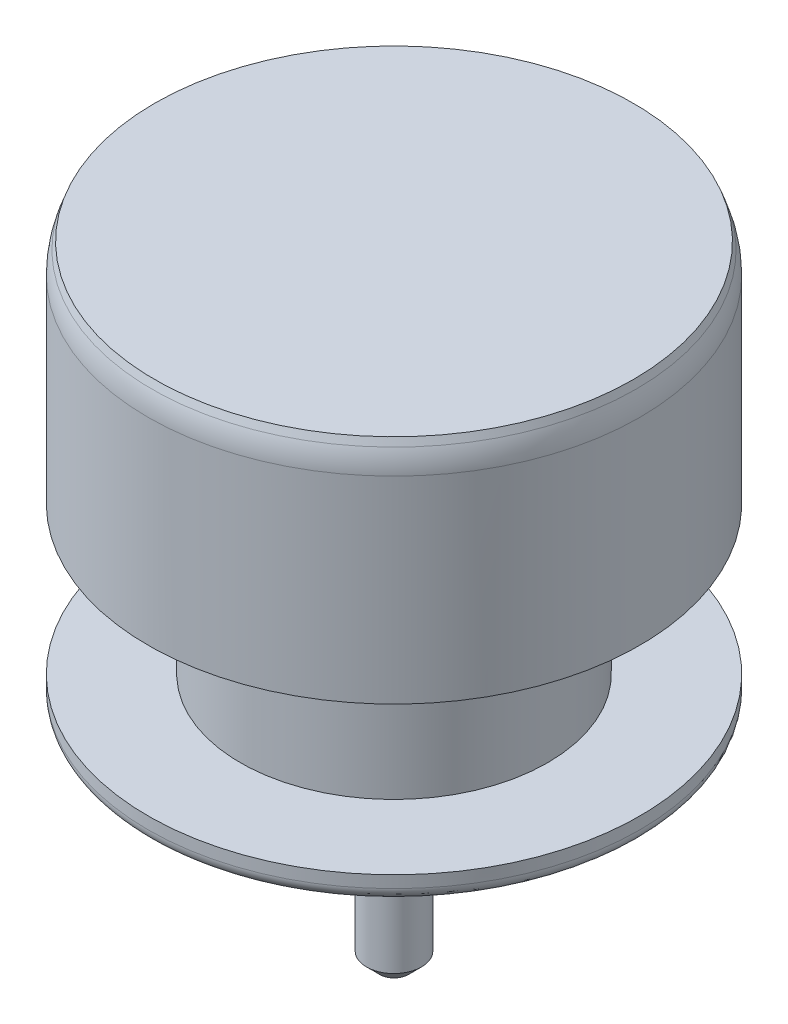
ISO-10303-21;
HEADER;
FILE_DESCRIPTION(('STEP AP214'),'2;1');
FILE_NAME('part.step','',(''),(''),'','','');
FILE_SCHEMA(('AUTOMOTIVE_DESIGN { 1 0 10303 214 1 1 1 1 }'));
ENDSEC;
DATA;
#1=APPLICATION_CONTEXT('core data for automotive mechanical design processes');
#2=APPLICATION_PROTOCOL_DEFINITION('international standard','automotive_design',2000,#1);
#3=PRODUCT_CONTEXT('',#1,'mechanical');
#4=PRODUCT('Part','Part','',(#3));
#5=PRODUCT_RELATED_PRODUCT_CATEGORY('part','',(#4));
#6=PRODUCT_DEFINITION_FORMATION('','',#4);
#7=PRODUCT_DEFINITION_CONTEXT('part definition',#1,'design');
#8=PRODUCT_DEFINITION('design','',#6,#7);
#9=PRODUCT_DEFINITION_SHAPE('','',#8);
#10=(LENGTH_UNIT() NAMED_UNIT(*) SI_UNIT(.MILLI.,.METRE.));
#11=(NAMED_UNIT(*) PLANE_ANGLE_UNIT() SI_UNIT($,.RADIAN.));
#12=(NAMED_UNIT(*) SI_UNIT($,.STERADIAN.) SOLID_ANGLE_UNIT());
#13=UNCERTAINTY_MEASURE_WITH_UNIT(LENGTH_MEASURE(1.E-05),#10,'distance_accuracy_value','');
#14=(GEOMETRIC_REPRESENTATION_CONTEXT(3) GLOBAL_UNCERTAINTY_ASSIGNED_CONTEXT((#13)) GLOBAL_UNIT_ASSIGNED_CONTEXT((#10,
#11,#12)) REPRESENTATION_CONTEXT('',''));
#15=CARTESIAN_POINT('',(0.,0.,0.));
#16=DIRECTION('',(0.,0.,1.));
#17=DIRECTION('',(1.,0.,0.));
#18=AXIS2_PLACEMENT_3D('',#15,#16,#17);
#19=CARTESIAN_POINT('',(3.66,0.,0.));
#20=DIRECTION('',(0.,-1.,0.));
#21=DIRECTION('',(1.,0.,0.));
#22=AXIS2_PLACEMENT_3D('',#19,#20,#21);
#23=PLANE('',#22);
#24=CARTESIAN_POINT('',(0.,0.,0.));
#25=DIRECTION('',(0.,1.,0.));
#26=DIRECTION('',(-1.,0.,0.));
#27=AXIS2_PLACEMENT_3D('',#24,#25,#26);
#28=CIRCLE('',#27,3.66);
#29=CARTESIAN_POINT('',(-3.66,0.,0.));
#30=VERTEX_POINT('',#29);
#31=EDGE_CURVE('E75',#30,#30,#28,.T.);
#32=ORIENTED_EDGE('',*,*,#31,.T.);
#33=EDGE_LOOP('',(#32));
#34=FACE_BOUND('',#33,.T.);
#35=ADVANCED_FACE('F34',(#34),#23,.F.);
#36=CARTESIAN_POINT('',(0.420000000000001,-9.6,0.));
#37=DIRECTION('',(0.,1.,0.));
#38=DIRECTION('',(-1.,0.,0.));
#39=AXIS2_PLACEMENT_3D('',#36,#37,#38);
#40=PLANE('',#39);
#41=CARTESIAN_POINT('',(0.,-9.6,0.));
#42=DIRECTION('',(0.,1.,0.));
#43=DIRECTION('',(-1.,0.,0.));
#44=AXIS2_PLACEMENT_3D('',#41,#42,#43);
#45=CIRCLE('',#44,0.219999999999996);
#46=CARTESIAN_POINT('',(-0.219999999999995,-9.6,0.));
#47=VERTEX_POINT('',#46);
#48=EDGE_CURVE('E10',#47,#47,#45,.F.);
#49=ORIENTED_EDGE('',*,*,#48,.T.);
#50=EDGE_LOOP('',(#49));
#51=FACE_BOUND('',#50,.T.);
#52=ADVANCED_FACE('F97',(#51),#40,.F.);
#53=CARTESIAN_POINT('',(0.,0.,0.));
#54=DIRECTION('',(0.,1.,0.));
#55=DIRECTION('',(-1.,0.,0.));
#56=AXIS2_PLACEMENT_3D('',#53,#54,#55);
#57=CYLINDRICAL_SURFACE('',#56,0.42);
#58=CARTESIAN_POINT('',(0.,-9.4,0.));
#59=DIRECTION('',(0.,1.,0.));
#60=DIRECTION('',(-1.,0.,0.));
#61=AXIS2_PLACEMENT_3D('',#58,#59,#60);
#62=CIRCLE('',#61,0.42);
#63=CARTESIAN_POINT('',(-0.419999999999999,-9.4,0.));
#64=VERTEX_POINT('',#63);
#65=EDGE_CURVE('E41',#64,#64,#62,.T.);
#66=ORIENTED_EDGE('',*,*,#65,.T.);
#67=EDGE_LOOP('',(#66));
#68=FACE_BOUND('',#67,.T.);
#69=CARTESIAN_POINT('',(0.,-7.95751288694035,0.));
#70=DIRECTION('',(0.,1.,0.));
#71=DIRECTION('',(-1.,0.,0.));
#72=AXIS2_PLACEMENT_3D('',#69,#70,#71);
#73=CIRCLE('',#72,0.42);
#74=CARTESIAN_POINT('',(-0.419999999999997,-7.95751288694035,0.));
#75=VERTEX_POINT('',#74);
#76=EDGE_CURVE('E60',#75,#75,#73,.T.);
#77=ORIENTED_EDGE('',*,*,#76,.F.);
#78=EDGE_LOOP('',(#77));
#79=FACE_BOUND('',#78,.T.);
#80=ADVANCED_FACE('F102',(#68,#79),#57,.T.);
#81=CARTESIAN_POINT('',(0.,-7.95751288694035,0.));
#82=DIRECTION('',(0.,1.,0.));
#83=DIRECTION('',(-1.,0.,0.));
#84=AXIS2_PLACEMENT_3D('',#81,#82,#83);
#85=CONICAL_SURFACE('',#84,0.42,1.04719755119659);
#86=CARTESIAN_POINT('',(0.,-6.08689801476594,0.));
#87=DIRECTION('',(0.,-1.,0.));
#88=DIRECTION('',(1.,0.,0.));
#89=AXIS2_PLACEMENT_3D('',#86,#87,#88);
#90=CIRCLE('',#89,3.66);
#91=CARTESIAN_POINT('',(-3.66,-6.08689801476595,0.));
#92=VERTEX_POINT('',#91);
#93=EDGE_CURVE('E54',#92,#92,#90,.T.);
#94=CARTESIAN_POINT('',(-3.66,-6.08689801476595,0.));
#95=CARTESIAN_POINT('',(-3.62625,-6.10638358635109,0.));
#96=CARTESIAN_POINT('',(-3.5925,-6.12586915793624,0.));
#97=CARTESIAN_POINT('',(-3.525,-6.16484030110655,0.));
#98=CARTESIAN_POINT('',(-3.49125,-6.1843258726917,0.));
#99=CARTESIAN_POINT('',(-3.42375,-6.223297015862,0.));
#100=CARTESIAN_POINT('',(-3.39,-6.24278258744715,0.));
#101=CARTESIAN_POINT('',(-3.3225,-6.28175373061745,0.));
#102=CARTESIAN_POINT('',(-3.28875,-6.3012393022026,0.));
#103=CARTESIAN_POINT('',(-3.22125,-6.3402104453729,0.));
#104=CARTESIAN_POINT('',(-3.1875,-6.35969601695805,0.));
#105=CARTESIAN_POINT('',(-3.12,-6.39866716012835,0.));
#106=CARTESIAN_POINT('',(-3.08625,-6.4181527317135,0.));
#107=CARTESIAN_POINT('',(-3.01875,-6.4571238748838,0.));
#108=CARTESIAN_POINT('',(-2.985,-6.47660944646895,0.));
#109=CARTESIAN_POINT('',(-2.9175,-6.51558058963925,0.));
#110=CARTESIAN_POINT('',(-2.88375,-6.5350661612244,0.));
#111=CARTESIAN_POINT('',(-2.81625,-6.5740373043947,0.));
#112=CARTESIAN_POINT('',(-2.7825,-6.59352287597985,0.));
#113=CARTESIAN_POINT('',(-2.715,-6.63249401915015,0.));
#114=CARTESIAN_POINT('',(-2.68125,-6.6519795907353,0.));
#115=CARTESIAN_POINT('',(-2.61375,-6.6909507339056,0.));
#116=CARTESIAN_POINT('',(-2.58,-6.71043630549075,0.));
#117=CARTESIAN_POINT('',(-2.5125,-6.74940744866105,0.));
#118=CARTESIAN_POINT('',(-2.47875,-6.7688930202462,0.));
#119=CARTESIAN_POINT('',(-2.41125,-6.8078641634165,0.));
#120=CARTESIAN_POINT('',(-2.3775,-6.82734973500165,0.));
#121=CARTESIAN_POINT('',(-2.31,-6.86632087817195,0.));
#122=CARTESIAN_POINT('',(-2.27625,-6.8858064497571,0.));
#123=CARTESIAN_POINT('',(-2.20875,-6.9247775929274,0.));
#124=CARTESIAN_POINT('',(-2.175,-6.94426316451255,0.));
#125=CARTESIAN_POINT('',(-2.1075,-6.98323430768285,0.));
#126=CARTESIAN_POINT('',(-2.07375,-7.002719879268,0.));
#127=CARTESIAN_POINT('',(-2.00625,-7.0416910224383,0.));
#128=CARTESIAN_POINT('',(-1.9725,-7.06117659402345,0.));
#129=CARTESIAN_POINT('',(-1.905,-7.10014773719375,0.));
#130=CARTESIAN_POINT('',(-1.87125,-7.1196333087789,0.));
#131=CARTESIAN_POINT('',(-1.80375,-7.1586044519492,0.));
#132=CARTESIAN_POINT('',(-1.77,-7.17809002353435,0.));
#133=CARTESIAN_POINT('',(-1.7025,-7.21706116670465,0.));
#134=CARTESIAN_POINT('',(-1.66875,-7.2365467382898,0.));
#135=CARTESIAN_POINT('',(-1.60125,-7.2755178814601,0.));
#136=CARTESIAN_POINT('',(-1.5675,-7.29500345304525,0.));
#137=CARTESIAN_POINT('',(-1.5,-7.33397459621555,0.));
#138=CARTESIAN_POINT('',(-1.46625,-7.3534601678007,0.));
#139=CARTESIAN_POINT('',(-1.39875,-7.392431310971,0.));
#140=CARTESIAN_POINT('',(-1.365,-7.41191688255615,0.));
#141=CARTESIAN_POINT('',(-1.2975,-7.45088802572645,0.));
#142=CARTESIAN_POINT('',(-1.26375,-7.4703735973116,0.));
#143=CARTESIAN_POINT('',(-1.19625,-7.5093447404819,0.));
#144=CARTESIAN_POINT('',(-1.1625,-7.52883031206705,0.));
#145=CARTESIAN_POINT('',(-1.095,-7.56780145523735,0.));
#146=CARTESIAN_POINT('',(-1.06125,-7.5872870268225,0.));
#147=CARTESIAN_POINT('',(-0.993749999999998,-7.6262581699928,0.));
#148=CARTESIAN_POINT('',(-0.959999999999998,-7.64574374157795,0.));
#149=CARTESIAN_POINT('',(-0.892499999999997,-7.68471488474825,0.));
#150=CARTESIAN_POINT('',(-0.858749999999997,-7.7042004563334,0.));
#151=CARTESIAN_POINT('',(-0.791249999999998,-7.7431715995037,0.));
#152=CARTESIAN_POINT('',(-0.757499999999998,-7.76265717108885,0.));
#153=CARTESIAN_POINT('',(-0.689999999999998,-7.80162831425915,0.));
#154=CARTESIAN_POINT('',(-0.656249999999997,-7.8211138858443,0.));
#155=CARTESIAN_POINT('',(-0.588749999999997,-7.8600850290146,0.));
#156=CARTESIAN_POINT('',(-0.554999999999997,-7.87957060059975,0.));
#157=CARTESIAN_POINT('',(-0.487499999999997,-7.91854174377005,0.));
#158=CARTESIAN_POINT('',(-0.453749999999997,-7.9380273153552,0.));
#159=CARTESIAN_POINT('',(-0.419999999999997,-7.95751288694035,0.));
#160=B_SPLINE_CURVE_WITH_KNOTS('',3,(#94,#95,#96,#97,#98,#99,#100,#101,#102,#103,#104,#105,#106,
#107,#108,#109,#110,#111,#112,#113,#114,#115,#116,#117,#118,#119,#120,#121,#122,#123,#124,#125,
#126,#127,#128,#129,#130,#131,#132,#133,#134,#135,#136,#137,#138,#139,#140,#141,#142,#143,#144,
#145,#146,#147,#148,#149,#150,#151,#152,#153,#154,#155,#156,#157,#158,#159),.UNSPECIFIED.,.F.,
.F.,(4,2,2,2,2,2,2,2,2,2,2,2,2,2,2,2,2,2,2,2,2,2,2,2,2,2,2,2,2,2,2,2,4),(0.,0.116913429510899,
0.233826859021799,0.350740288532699,0.467653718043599,0.584567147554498,0.701480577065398,
0.818394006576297,0.935307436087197,1.0522208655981,1.169134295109,1.2860477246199,
1.40296115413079,1.51987458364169,1.63678801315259,1.75370144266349,1.87061487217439,
1.98752830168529,2.10444173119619,2.22135516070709,2.33826859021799,2.45518201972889,
2.57209544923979,2.68900887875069,2.80592230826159,2.92283573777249,3.03974916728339,
3.15666259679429,3.27357602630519,3.39048945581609,3.50740288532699,3.62431631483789,
3.74122974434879),.UNSPECIFIED.);
#161=EDGE_CURVE('BSEAM136',#92,#75,#160,.T.);
#162=ORIENTED_EDGE('',*,*,#93,.T.);
#163=ORIENTED_EDGE('',*,*,#76,.T.);
#164=ORIENTED_EDGE('',*,*,#161,.T.);
#165=ORIENTED_EDGE('',*,*,#161,.F.);
#166=EDGE_LOOP('',(#162,#164,#163,#165));
#167=FACE_BOUND('',#166,.T.);
#168=ADVANCED_FACE('F136',(#167),#85,.T.);
#169=CARTESIAN_POINT('',(0.,0.,0.));
#170=DIRECTION('',(0.,1.,0.));
#171=DIRECTION('',(-1.,0.,0.));
#172=AXIS2_PLACEMENT_3D('',#169,#170,#171);
#173=CYLINDRICAL_SURFACE('',#172,3.76);
#174=CARTESIAN_POINT('',(0.,-5.91369293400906,0.));
#175=DIRECTION('',(0.,-1.,0.));
#176=DIRECTION('',(1.,0.,0.));
#177=AXIS2_PLACEMENT_3D('',#174,#175,#176);
#178=CIRCLE('',#177,3.76);
#179=CARTESIAN_POINT('',(3.76,-5.91369293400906,0.));
#180=VERTEX_POINT('',#179);
#181=EDGE_CURVE('E57',#180,#180,#178,.F.);
#182=ORIENTED_EDGE('',*,*,#181,.T.);
#183=EDGE_LOOP('',(#182));
#184=FACE_BOUND('',#183,.T.);
#185=CARTESIAN_POINT('',(0.,-5.73,0.));
#186=DIRECTION('',(0.,1.,0.));
#187=DIRECTION('',(-1.,0.,0.));
#188=AXIS2_PLACEMENT_3D('',#185,#186,#187);
#189=CIRCLE('',#188,3.76);
#190=CARTESIAN_POINT('',(-3.76,-5.73,0.));
#191=VERTEX_POINT('',#190);
#192=EDGE_CURVE('E63',#191,#191,#189,.T.);
#193=ORIENTED_EDGE('',*,*,#192,.F.);
#194=EDGE_LOOP('',(#193));
#195=FACE_BOUND('',#194,.T.);
#196=ADVANCED_FACE('F131',(#184,#195),#173,.T.);
#197=CARTESIAN_POINT('',(3.76,-5.73,0.));
#198=DIRECTION('',(0.,-1.,0.));
#199=DIRECTION('',(1.,0.,0.));
#200=AXIS2_PLACEMENT_3D('',#197,#198,#199);
#201=PLANE('',#200);
#202=CARTESIAN_POINT('',(0.,-5.73,0.));
#203=DIRECTION('',(0.,1.,0.));
#204=DIRECTION('',(-1.,0.,0.));
#205=AXIS2_PLACEMENT_3D('',#202,#203,#204);
#206=CIRCLE('',#205,2.35);
#207=CARTESIAN_POINT('',(-2.35,-5.73,0.));
#208=VERTEX_POINT('',#207);
#209=EDGE_CURVE('E66',#208,#208,#206,.T.);
#210=ORIENTED_EDGE('',*,*,#209,.F.);
#211=EDGE_LOOP('',(#210));
#212=FACE_BOUND('',#211,.T.);
#213=ORIENTED_EDGE('',*,*,#192,.T.);
#214=EDGE_LOOP('',(#213));
#215=FACE_BOUND('',#214,.T.);
#216=ADVANCED_FACE('F125',(#212,#215),#201,.F.);
#217=CARTESIAN_POINT('',(0.,0.,0.));
#218=DIRECTION('',(0.,1.,0.));
#219=DIRECTION('',(-1.,0.,0.));
#220=AXIS2_PLACEMENT_3D('',#217,#218,#219);
#221=CYLINDRICAL_SURFACE('',#220,2.35);
#222=CARTESIAN_POINT('',(0.,-3.47,0.));
#223=DIRECTION('',(0.,1.,0.));
#224=DIRECTION('',(-1.,0.,0.));
#225=AXIS2_PLACEMENT_3D('',#222,#223,#224);
#226=CIRCLE('',#225,2.35);
#227=CARTESIAN_POINT('',(-2.35,-3.47,0.));
#228=VERTEX_POINT('',#227);
#229=EDGE_CURVE('E69',#228,#228,#226,.T.);
#230=ORIENTED_EDGE('',*,*,#229,.F.);
#231=EDGE_LOOP('',(#230));
#232=FACE_BOUND('',#231,.T.);
#233=ORIENTED_EDGE('',*,*,#209,.T.);
#234=EDGE_LOOP('',(#233));
#235=FACE_BOUND('',#234,.T.);
#236=ADVANCED_FACE('F119',(#232,#235),#221,.T.);
#237=CARTESIAN_POINT('',(2.35,-3.47,0.));
#238=DIRECTION('',(0.,1.,0.));
#239=DIRECTION('',(-1.,0.,0.));
#240=AXIS2_PLACEMENT_3D('',#237,#238,#239);
#241=PLANE('',#240);
#242=CARTESIAN_POINT('',(0.,-3.47,0.));
#243=DIRECTION('',(0.,1.,0.));
#244=DIRECTION('',(-1.,0.,0.));
#245=AXIS2_PLACEMENT_3D('',#242,#243,#244);
#246=CIRCLE('',#245,3.76);
#247=CARTESIAN_POINT('',(-3.76,-3.47,0.));
#248=VERTEX_POINT('',#247);
#249=EDGE_CURVE('E72',#248,#248,#246,.T.);
#250=ORIENTED_EDGE('',*,*,#249,.F.);
#251=EDGE_LOOP('',(#250));
#252=FACE_BOUND('',#251,.T.);
#253=ORIENTED_EDGE('',*,*,#229,.T.);
#254=EDGE_LOOP('',(#253));
#255=FACE_BOUND('',#254,.T.);
#256=ADVANCED_FACE('F93',(#252,#255),#241,.F.);
#257=CARTESIAN_POINT('',(0.,0.,0.));
#258=DIRECTION('',(0.,1.,0.));
#259=DIRECTION('',(-1.,0.,0.));
#260=AXIS2_PLACEMENT_3D('',#257,#258,#259);
#261=CYLINDRICAL_SURFACE('',#260,3.76);
#262=CARTESIAN_POINT('',(0.,-0.451074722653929,0.));
#263=DIRECTION('',(0.,-1.,0.));
#264=DIRECTION('',(1.,0.,0.));
#265=AXIS2_PLACEMENT_3D('',#262,#263,#264);
#266=CIRCLE('',#265,3.76);
#267=CARTESIAN_POINT('',(3.76,-0.451074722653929,0.));
#268=VERTEX_POINT('',#267);
#269=EDGE_CURVE('E45',#268,#268,#266,.T.);
#270=ORIENTED_EDGE('',*,*,#269,.T.);
#271=EDGE_LOOP('',(#270));
#272=FACE_BOUND('',#271,.T.);
#273=ORIENTED_EDGE('',*,*,#249,.T.);
#274=EDGE_LOOP('',(#273));
#275=FACE_BOUND('',#274,.T.);
#276=ADVANCED_FACE('F83',(#272,#275),#261,.T.);
#277=CARTESIAN_POINT('',(0.,-0.274747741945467,0.));
#278=DIRECTION('',(0.,-1.,0.));
#279=DIRECTION('',(1.,0.,0.));
#280=AXIS2_PLACEMENT_3D('',#277,#278,#279);
#281=CONICAL_SURFACE('',#280,3.76,0.34906585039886);
#282=CARTESIAN_POINT('',(0.,-0.109054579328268,0.));
#283=DIRECTION('',(0.,1.,0.));
#284=DIRECTION('',(-1.,0.,0.));
#285=AXIS2_PLACEMENT_3D('',#282,#283,#284);
#286=CIRCLE('',#285,3.69969262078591);
#287=CARTESIAN_POINT('',(-3.69969262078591,-0.109054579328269,0.));
#288=VERTEX_POINT('',#287);
#289=EDGE_CURVE('E49',#288,#288,#286,.T.);
#290=ORIENTED_EDGE('',*,*,#289,.T.);
#291=EDGE_LOOP('',(#290));
#292=FACE_BOUND('',#291,.T.);
#293=ORIENTED_EDGE('',*,*,#31,.F.);
#294=EDGE_LOOP('',(#293));
#295=FACE_BOUND('',#294,.T.);
#296=ADVANCED_FACE('F80',(#292,#295),#281,.T.);
#297=CARTESIAN_POINT('',(0.,-5.91369293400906,0.));
#298=DIRECTION('',(0.,-1.,0.));
#299=DIRECTION('',(1.,0.,0.));
#300=AXIS2_PLACEMENT_3D('',#297,#298,#299);
#301=TOROIDAL_SURFACE('',#300,3.56,0.2);
#302=ORIENTED_EDGE('',*,*,#93,.F.);
#303=EDGE_LOOP('',(#302));
#304=FACE_BOUND('',#303,.T.);
#305=ORIENTED_EDGE('',*,*,#181,.F.);
#306=EDGE_LOOP('',(#305));
#307=FACE_BOUND('',#306,.T.);
#308=ADVANCED_FACE('F82',(#304,#307),#301,.T.);
#309=CARTESIAN_POINT('',(0.,-0.451074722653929,0.));
#310=DIRECTION('',(0.,-1.,0.));
#311=DIRECTION('',(1.,0.,0.));
#312=AXIS2_PLACEMENT_3D('',#309,#310,#311);
#313=TOROIDAL_SURFACE('',#312,2.76,1.);
#314=ORIENTED_EDGE('',*,*,#269,.F.);
#315=EDGE_LOOP('',(#314));
#316=FACE_BOUND('',#315,.T.);
#317=ORIENTED_EDGE('',*,*,#289,.F.);
#318=EDGE_LOOP('',(#317));
#319=FACE_BOUND('',#318,.T.);
#320=ADVANCED_FACE('F90',(#316,#319),#313,.T.);
#321=CARTESIAN_POINT('',(0.,-9.4,0.));
#322=DIRECTION('',(0.,1.,0.));
#323=DIRECTION('',(-1.,0.,0.));
#324=AXIS2_PLACEMENT_3D('',#321,#322,#323);
#325=CONICAL_SURFACE('',#324,0.42,0.785398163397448);
#326=ORIENTED_EDGE('',*,*,#48,.F.);
#327=EDGE_LOOP('',(#326));
#328=FACE_BOUND('',#327,.T.);
#329=ORIENTED_EDGE('',*,*,#65,.F.);
#330=EDGE_LOOP('',(#329));
#331=FACE_BOUND('',#330,.T.);
#332=ADVANCED_FACE('F36',(#328,#331),#325,.T.);
#333=CLOSED_SHELL('',(#35,#52,#80,#168,#196,#216,#236,#256,#276,#296,#308,#320,#332));
#334=MANIFOLD_SOLID_BREP('B2',#333);
#335=ADVANCED_BREP_SHAPE_REPRESENTATION('',(#18,#334),#14);
#336=SHAPE_DEFINITION_REPRESENTATION(#9,#335);
ENDSEC;
END-ISO-10303-21;
